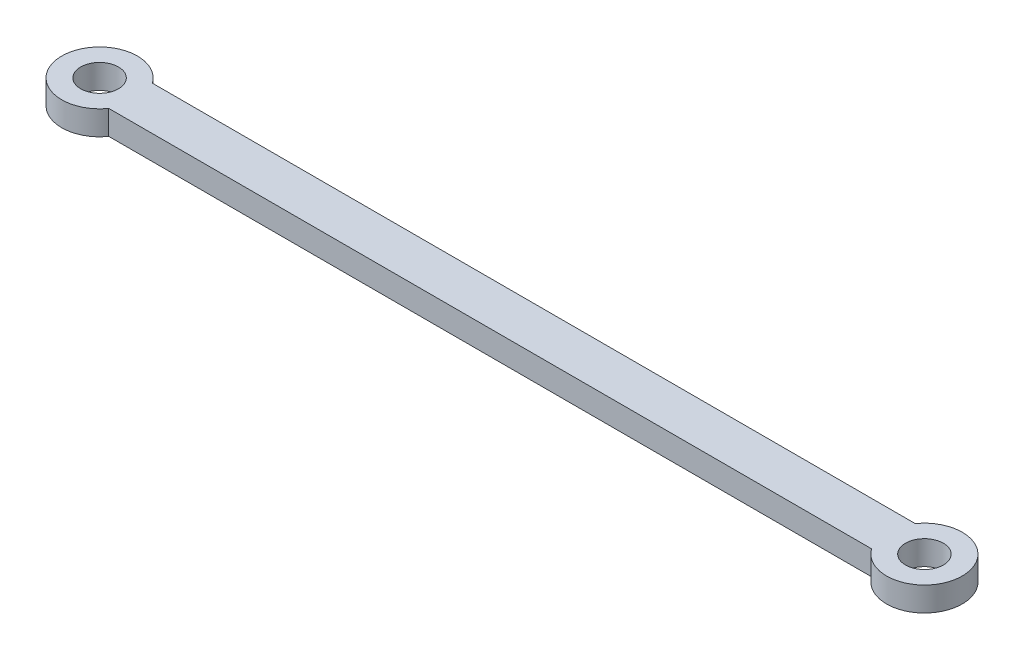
from build123d import *

# Parameters (mm, degrees)
SKETCH1_R           = 3.9
BOSS_EXTRUDE1_DEPTH = 5


with BuildPart() as part:
    # Sketch1 → Boss-Extrude1 (new body)
    with BuildSketch(Plane(origin=(0, 0, 0), x_dir=(1, 0, 0), z_dir=(0, 1, 0))):
        with BuildLine():
            Line((-78.616427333, -4.5), (78.616427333, -4.5))
            ThreePointArc((78.616427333, -4.5), (92.810249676, 0), (78.616427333, 4.5))
            Line((78.616427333, 4.5), (-78.616427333, 4.5))
            ThreePointArc((-78.616427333, 4.5), (-92.810249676, 0), (-78.616427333, -4.5))
        make_face()
        with Locations(Location((85, 0, 0), (0, 0, 270))):
            Circle(SKETCH1_R, mode=Mode.SUBTRACT)
        with Locations(Location((-85, 0, 0), (0, 0, 90))):
            Circle(SKETCH1_R, mode=Mode.SUBTRACT)
    extrude(amount=BOSS_EXTRUDE1_DEPTH)


solid = part.part
